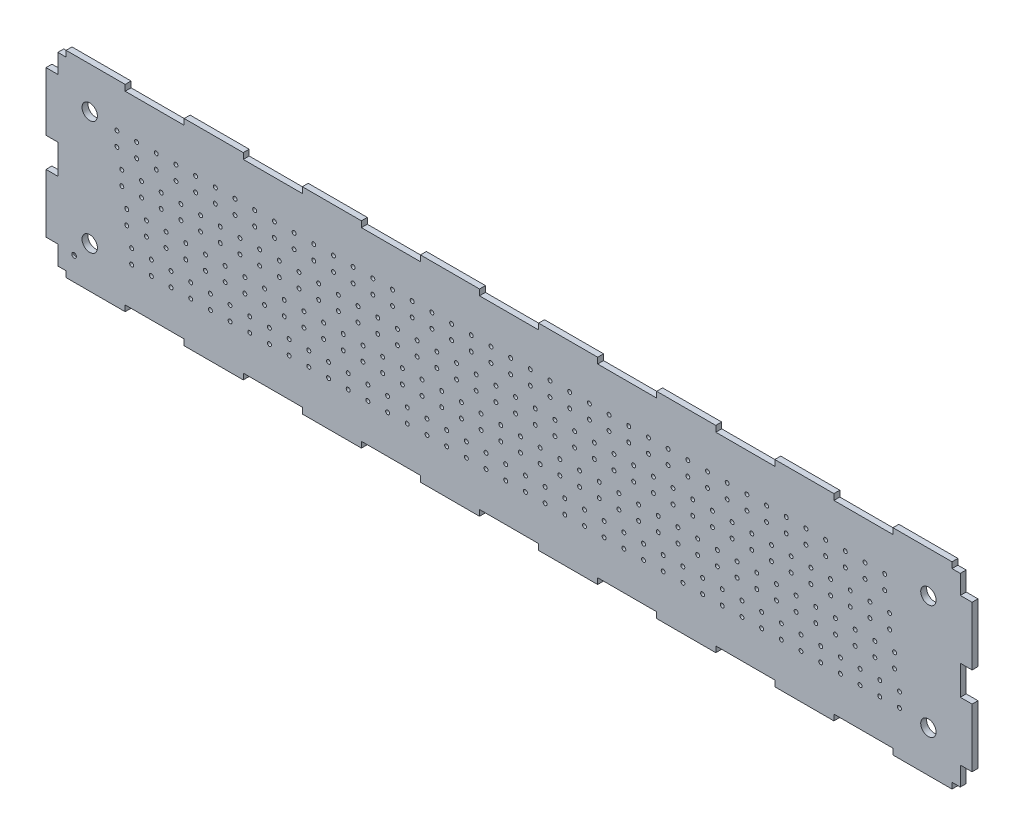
from build123d import *

# Parameters (mm, degrees)
CROQUIS1_W              = 458.4
CROQUIS1_H              = 100
SALIENTE_EXTRUIR1_DEPTH = 3
CROQUIS2_W              = 3
CROQUIS2_H              = 29.8
SALIENTE_EXTRUIR2_DEPTH = 6
CROQUIS3_W              = 3
CROQUIS3_H              = 29.8
SALIENTE_EXTRUIR3_DEPTH = 6
CORTAR_EXTRUIR1_REACH   = 242.475
CROQUIS4_R              = 3.9
CORTAR_EXTRUIR2_REACH   = 242.475
CROQUIS6_R              = 1
MATRIZL1_COUNT          = 40
MATRIZL1_PITCH          = 10
CROQUIS8_W              = 30
CROQUIS8_H              = 3
CROQUIS8_W_2            = 4.2
CORTAR_EXTRUIR4_DEPTH   = 3
CROQUIS9_W              = 30
CROQUIS9_H              = 3
CROQUIS9_W_2            = 4.2
CORTAR_EXTRUIR5_DEPTH   = 3
CROQUIS10_R             = 1.192000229
CORTAR_EXTRUIR6_DEPTH   = 1


with BuildPart() as part:
    # Croquis1 → Saliente-Extruir1 (new body)
    with BuildSketch(Plane.XY):
        Rectangle(CROQUIS1_W, CROQUIS1_H)
    extrude(amount=SALIENTE_EXTRUIR1_DEPTH)

    # Croquis2 → Saliente-Extruir2 (add)
    with BuildSketch(Plane.ZY.offset(229.2)):
        with Locations((1.5, 22.4)):
            Rectangle(CROQUIS2_W, CROQUIS2_H)
        with Locations((1.5, -22.4)):
            Rectangle(CROQUIS2_W, CROQUIS2_H)
    extrude(amount=SALIENTE_EXTRUIR2_DEPTH)

    # Croquis3 → Saliente-Extruir3 (add)
    with BuildSketch(Plane(origin=(229.2, 0, 0), x_dir=(0, 0, -1), z_dir=(1, 0, 0))):
        with Locations((-1.5, -22.4)):
            Rectangle(CROQUIS3_W, CROQUIS3_H)
        with Locations((-1.5, 22.4)):
            Rectangle(CROQUIS3_W, CROQUIS3_H)
    extrude(amount=SALIENTE_EXTRUIR3_DEPTH)

    # Croquis4 → Cortar-Extruir1 (cut, up to next)
    with BuildSketch(Plane.XY.offset(3), mode=Mode.PRIVATE) as cortar_extruir1_sk1:
        with Locations((-213, 29)):
            Circle(CROQUIS4_R)
    cortar_extruir1_tool1 = extrude(cortar_extruir1_sk1.sketch, amount=-CORTAR_EXTRUIR1_REACH, mode=Mode.PRIVATE) & part.part
    # Croquis4 → Cortar-Extruir1 (cut, up to next)
    with BuildSketch(Plane.XY.offset(3), mode=Mode.PRIVATE) as cortar_extruir1_sk2:
        with Locations(Location((-213, -29, 0), (0, 0, 180))):
            Circle(CROQUIS4_R)
    cortar_extruir1_tool2 = extrude(cortar_extruir1_sk2.sketch, amount=-CORTAR_EXTRUIR1_REACH, mode=Mode.PRIVATE) & part.part
    # Croquis4 → Cortar-Extruir1 (cut, up to next)
    with BuildSketch(Plane.XY.offset(3), mode=Mode.PRIVATE) as cortar_extruir1_sk3:
        with Locations((213, -29)):
            Circle(CROQUIS4_R)
    cortar_extruir1_tool3 = extrude(cortar_extruir1_sk3.sketch, amount=-CORTAR_EXTRUIR1_REACH, mode=Mode.PRIVATE) & part.part
    # Croquis4 → Cortar-Extruir1 (cut, up to next)
    with BuildSketch(Plane.XY.offset(3), mode=Mode.PRIVATE) as cortar_extruir1_sk4:
        with Locations(Location((213, 29, 0), (0, 0, 180))):
            Circle(CROQUIS4_R)
    cortar_extruir1_tool4 = extrude(cortar_extruir1_sk4.sketch, amount=-CORTAR_EXTRUIR1_REACH, mode=Mode.PRIVATE) & part.part
    add(cortar_extruir1_tool1.solids().sort_by_distance((-213, 29, 3))[0], mode=Mode.SUBTRACT)
    add(cortar_extruir1_tool2.solids().sort_by_distance((-213, -29, 3))[0], mode=Mode.SUBTRACT)
    add(cortar_extruir1_tool3.solids().sort_by_distance((213, -29, 3))[0], mode=Mode.SUBTRACT)
    add(cortar_extruir1_tool4.solids().sort_by_distance((213, 29, 3))[0], mode=Mode.SUBTRACT)

    # Croquis6 → Cortar-Extruir2 (cut, up to next)
    with BuildSketch(Plane.XY.offset(3), mode=Mode.PRIVATE) as cortar_extruir2_sk1:
        with Locations((-199.2, 27.6)):
            Circle(CROQUIS6_R)
    cortar_extruir2_tool1 = extrude(cortar_extruir2_sk1.sketch, amount=-CORTAR_EXTRUIR2_REACH, mode=Mode.PRIVATE) & part.part
    # Croquis6 → Cortar-Extruir2 (cut, up to next)
    with BuildSketch(Plane.XY.offset(3), mode=Mode.PRIVATE) as cortar_extruir2_sk2:
        with Locations((-199.2, 20.4)):
            Circle(CROQUIS6_R)
    cortar_extruir2_tool2 = extrude(cortar_extruir2_sk2.sketch, amount=-CORTAR_EXTRUIR2_REACH, mode=Mode.PRIVATE) & part.part
    # Croquis6 → Cortar-Extruir2 (cut, up to next)
    with BuildSketch(Plane.XY.offset(3), mode=Mode.PRIVATE) as cortar_extruir2_sk3:
        with Locations((-196.7, 11.6)):
            Circle(CROQUIS6_R)
    cortar_extruir2_tool3 = extrude(cortar_extruir2_sk3.sketch, amount=-CORTAR_EXTRUIR2_REACH, mode=Mode.PRIVATE) & part.part
    # Croquis6 → Cortar-Extruir2 (cut, up to next)
    with BuildSketch(Plane.XY.offset(3), mode=Mode.PRIVATE) as cortar_extruir2_sk4:
        with Locations((-194.2, -4.4)):
            Circle(CROQUIS6_R)
    cortar_extruir2_tool4 = extrude(cortar_extruir2_sk4.sketch, amount=-CORTAR_EXTRUIR2_REACH, mode=Mode.PRIVATE) & part.part
    # Croquis6 → Cortar-Extruir2 (cut, up to next)
    with BuildSketch(Plane.XY.offset(3), mode=Mode.PRIVATE) as cortar_extruir2_sk5:
        with Locations((-191.7, -20.4)):
            Circle(CROQUIS6_R)
    cortar_extruir2_tool5 = extrude(cortar_extruir2_sk5.sketch, amount=-CORTAR_EXTRUIR2_REACH, mode=Mode.PRIVATE) & part.part
    # Croquis6 → Cortar-Extruir2 (cut, up to next)
    with BuildSketch(Plane.XY.offset(3), mode=Mode.PRIVATE) as cortar_extruir2_sk6:
        with Locations((-196.7, 4.4)):
            Circle(CROQUIS6_R)
    cortar_extruir2_tool6 = extrude(cortar_extruir2_sk6.sketch, amount=-CORTAR_EXTRUIR2_REACH, mode=Mode.PRIVATE) & part.part
    # Croquis6 → Cortar-Extruir2 (cut, up to next)
    with BuildSketch(Plane.XY.offset(3), mode=Mode.PRIVATE) as cortar_extruir2_sk7:
        with Locations((-194.2, -11.6)):
            Circle(CROQUIS6_R)
    cortar_extruir2_tool7 = extrude(cortar_extruir2_sk7.sketch, amount=-CORTAR_EXTRUIR2_REACH, mode=Mode.PRIVATE) & part.part
    # Croquis6 → Cortar-Extruir2 (cut, up to next)
    with BuildSketch(Plane.XY.offset(3), mode=Mode.PRIVATE) as cortar_extruir2_sk8:
        with Locations((-191.7, -27.6)):
            Circle(CROQUIS6_R)
    cortar_extruir2_tool8 = extrude(cortar_extruir2_sk8.sketch, amount=-CORTAR_EXTRUIR2_REACH, mode=Mode.PRIVATE) & part.part
    cortar_extruir2_1 = cortar_extruir2_tool1.solids().sort_by_distance((-199.2, 27.6, 3))[0]
    add(cortar_extruir2_1, mode=Mode.SUBTRACT)
    cortar_extruir2_2 = cortar_extruir2_tool2.solids().sort_by_distance((-199.2, 20.4, 3))[0]
    add(cortar_extruir2_2, mode=Mode.SUBTRACT)
    cortar_extruir2_3 = cortar_extruir2_tool3.solids().sort_by_distance((-196.7, 11.6, 3))[0]
    add(cortar_extruir2_3, mode=Mode.SUBTRACT)
    cortar_extruir2_4 = cortar_extruir2_tool4.solids().sort_by_distance((-194.2, -4.4, 3))[0]
    add(cortar_extruir2_4, mode=Mode.SUBTRACT)
    cortar_extruir2_5 = cortar_extruir2_tool5.solids().sort_by_distance((-191.7, -20.4, 3))[0]
    add(cortar_extruir2_5, mode=Mode.SUBTRACT)
    cortar_extruir2_6 = cortar_extruir2_tool6.solids().sort_by_distance((-196.7, 4.4, 3))[0]
    add(cortar_extruir2_6, mode=Mode.SUBTRACT)
    cortar_extruir2_7 = cortar_extruir2_tool7.solids().sort_by_distance((-194.2, -11.6, 3))[0]
    add(cortar_extruir2_7, mode=Mode.SUBTRACT)
    cortar_extruir2_8 = cortar_extruir2_tool8.solids().sort_by_distance((-191.7, -27.6, 3))[0]
    add(cortar_extruir2_8, mode=Mode.SUBTRACT)
    cortar_extruir2 = cortar_extruir2_1 + cortar_extruir2_2 + cortar_extruir2_3 + cortar_extruir2_4 + cortar_extruir2_5 + cortar_extruir2_6 + cortar_extruir2_7 + cortar_extruir2_8  # Cortar-Extruir2 as one shape, for the pattern or mirror that repeats it

    # MatrizL1: Cortar-Extruir2 ×40
    with Locations(*[(i * MATRIZL1_PITCH, 0, 0) for i in range(1, MATRIZL1_COUNT)]):
        add(cortar_extruir2, mode=Mode.SUBTRACT)

    # Croquis8 → Cortar-Extruir4 (cut)
    with BuildSketch(Plane.XZ.offset(50)):
        with Locations((0, 1.5)):
            Rectangle(CROQUIS8_W, CROQUIS8_H)
        with Locations((227.1, 1.5)):
            Rectangle(CROQUIS8_W_2, CROQUIS8_H)
        with Locations((-60, 1.5)):
            Rectangle(CROQUIS8_W, CROQUIS8_H)
        with Locations((-120, 1.5)):
            Rectangle(CROQUIS8_W, CROQUIS8_H)
        with Locations((-180, 1.5)):
            Rectangle(CROQUIS8_W, CROQUIS8_H)
        with Locations((-227.1, 1.5)):
            Rectangle(CROQUIS8_W_2, CROQUIS8_H)
        with Locations((180, 1.5)):
            Rectangle(CROQUIS8_W, CROQUIS8_H)
        with Locations((120, 1.5)):
            Rectangle(CROQUIS8_W, CROQUIS8_H)
        with Locations((60, 1.5)):
            Rectangle(CROQUIS8_W, CROQUIS8_H)
    extrude(amount=-CORTAR_EXTRUIR4_DEPTH, mode=Mode.SUBTRACT)

    # Croquis9 → Cortar-Extruir5 (cut)
    with BuildSketch(Plane(origin=(0, 50, 0), x_dir=(1, 0, 0), z_dir=(0, 1, 0))):
        with Locations((0, -1.5)):
            Rectangle(CROQUIS9_W, CROQUIS9_H)
        with Locations((227.1, -1.5)):
            Rectangle(CROQUIS9_W_2, CROQUIS9_H)
        with Locations((-60, -1.5)):
            Rectangle(CROQUIS9_W, CROQUIS9_H)
        with Locations((-120, -1.5)):
            Rectangle(CROQUIS9_W, CROQUIS9_H)
        with Locations((-180, -1.5)):
            Rectangle(CROQUIS9_W, CROQUIS9_H)
        with Locations((-227.1, -1.5)):
            Rectangle(CROQUIS9_W_2, CROQUIS9_H)
        with Locations((180, -1.5)):
            Rectangle(CROQUIS9_W, CROQUIS9_H)
        with Locations((120, -1.5)):
            Rectangle(CROQUIS9_W, CROQUIS9_H)
        with Locations((60, -1.5)):
            Rectangle(CROQUIS9_W, CROQUIS9_H)
    extrude(amount=-CORTAR_EXTRUIR5_DEPTH, mode=Mode.SUBTRACT)

    # Croquis10 → Cortar-Extruir6 (cut)
    with BuildSketch(Plane.XY.offset(3)):
        with Locations((-220.91091378, -38.138581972)):
            Circle(CROQUIS10_R)
    extrude(amount=-CORTAR_EXTRUIR6_DEPTH, mode=Mode.SUBTRACT)


solid = part.part
